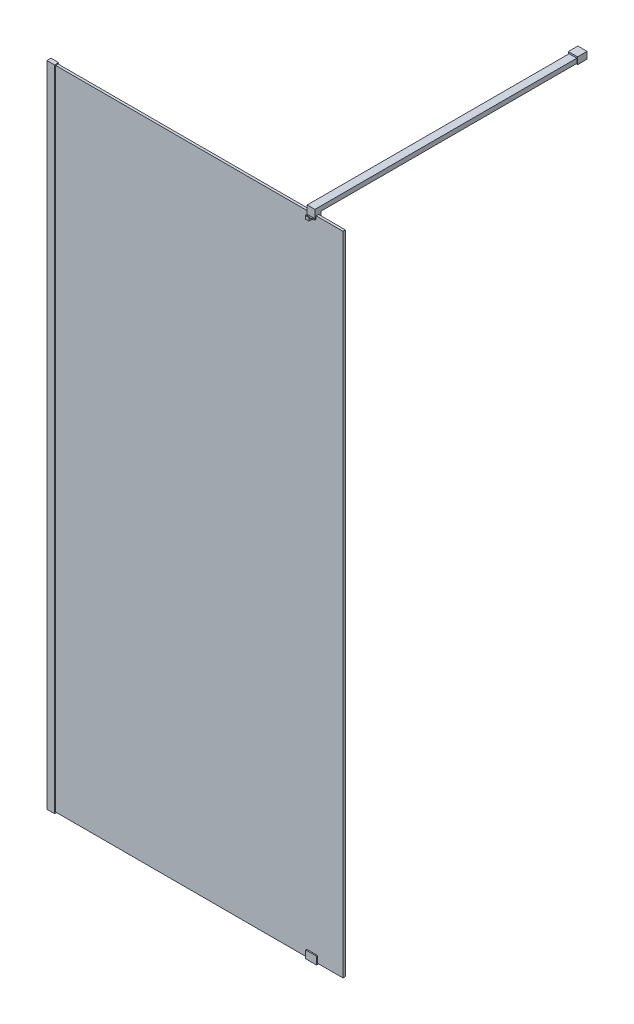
from build123d import *

# Parameters (mm, degrees)
DODANIE_WYCI_GNI_CIE1_DEPTH     = 2100
SZKIC2_W                        = 947
SZKIC2_H                        = 8
DODANIE_WYCI_GNI_CIE2_DEPTH     = 2100
SZKIC4_W                        = 25
SZKIC4_H                        = 13.3
DODANIE_WYCI_GNI_CIE3_DEPTH     = 3
SZKIC5_W                        = 25
SZKIC5_H                        = 13.3
DODANIE_WYCI_GNI_CIE4_DEPTH     = 3
DODANIE_WYCI_GNI_CIE5_DEPTH     = 17.5
DODANIE_WYCI_GNI_CIE6_DEPTH     = 12.5
WYTNIJ_WYCI_GNI_CIE1_DEPTH      = 2312.192714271
WYTNIJ_WYCI_GNI_CIE1_DEPTH_BACK = 2312.192714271
SZKIC10_W                       = 25
SZKIC10_H                       = 861.63
DODANIE_WYCI_GNI_CIE7_DEPTH     = 15
SZKIC14_W                       = 30
SZKIC14_H                       = 22
DODANIE_WYCI_GNI_CIE8_DEPTH     = 31


with BuildPart() as part:
    # Szkic1 → Dodanie-wyci_gni_cie1 (new body)
    with BuildSketch(Plane(origin=(0, 0, 0), x_dir=(1, 0, 0), z_dir=(0, 1, 0))):
        Polygon((0, 0), (0, 13.3), (25, 13.3), (25, 11.4), (11.45, 11.4), (11.45, 3.4), (25, 3.4), (25, 0), align=None)
    extrude(amount=DODANIE_WYCI_GNI_CIE1_DEPTH)

    # Szkic4 → Dodanie-wyci_gni_cie3 (add)
    with BuildSketch(Plane(origin=(0, 2100, 0), x_dir=(1, 0, 0), z_dir=(0, 1, 0))):
        with Locations((12.5, 6.65)):
            Rectangle(SZKIC4_W, SZKIC4_H)
    extrude(amount=DODANIE_WYCI_GNI_CIE3_DEPTH)

    # Szkic5 → Dodanie-wyci_gni_cie4 (add)
    with BuildSketch(Plane.XZ):
        with Locations((12.5, -6.65)):
            Rectangle(SZKIC5_W, SZKIC5_H)
    extrude(amount=DODANIE_WYCI_GNI_CIE4_DEPTH)


with BuildPart() as body_2:
    # Szkic2 → Dodanie-wyci_gni_cie2 (new body)
    with BuildSketch(Plane.XZ):
        with Locations((484.95, -7.4)):
            Rectangle(SZKIC2_W, SZKIC2_H)
    extrude(amount=-DODANIE_WYCI_GNI_CIE2_DEPTH)


with BuildPart() as body_3:
    # Szkic6 → Dodanie-wyci_gni_cie5 (new, symmetric)
    with BuildSketch(Plane(origin=(858.45, 0, 0), x_dir=(0, 0, -1), z_dir=(1, 0, 0))):
        Polygon((11.4, 22), (15.75, 22), (15.75, -3), (-0.35, -3), (-0.35, 22), (3.4, 22), (3.4, 0), (11.4, 0), align=None)
    extrude(amount=DODANIE_WYCI_GNI_CIE5_DEPTH, both=True)


with BuildPart() as body_4:
    # Szkic7 → Dodanie-wyci_gni_cie6 (new, symmetric)
    with BuildSketch(Plane(origin=(858.45, 0, 0), x_dir=(0, 0, -1), z_dir=(1, 0, 0))):
        Polygon((-0.6, 2120), (19.4, 2120), (19.4, 2090), (11.4, 2090), (11.4, 2100), (3.4, 2100), (3.4, 2090), (-13.37, 2090), (-13.37, 2100), (-10.37, 2100), (-9.845068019, 2094), (-0.6, 2094), align=None)
    extrude(amount=DODANIE_WYCI_GNI_CIE6_DEPTH, both=True)

    # Szkic8 → Wytnij-wyci_gni_cie1 (cut, two sides: drawn at the far end of the back side and taken through both)
    with BuildSketch(Plane(origin=(0, 2100, 0), x_dir=(1, 0, 0), z_dir=(0, 1, 0)).offset(-WYTNIJ_WYCI_GNI_CIE1_DEPTH_BACK)):
        Polygon((-742.226795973, 739.979002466), (845.95, -0.6), (852.45, -3.630999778), (852.45, -13.37), (864.45, -13.37), (864.45, -3.630999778), (870.95, -0.6), (2459.126795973, 739.979002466), (2459.126795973, -2764.739413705), (-742.226795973, -2764.739413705), align=None)
    extrude(amount=WYTNIJ_WYCI_GNI_CIE1_DEPTH + WYTNIJ_WYCI_GNI_CIE1_DEPTH_BACK, mode=Mode.SUBTRACT)

    # Szkic10 → Dodanie-wyci_gni_cie7 (add)
    with BuildSketch(Plane(origin=(0, 2120, 0), x_dir=(1, 0, 0), z_dir=(0, 1, 0))):
        with Locations((858.45, 450.215)):
            Rectangle(SZKIC10_W, SZKIC10_H)
    extrude(amount=-DODANIE_WYCI_GNI_CIE7_DEPTH)

    # Szkic14 → Dodanie-wyci_gni_cie8 (add)
    with BuildSketch(Plane(origin=(0, 0, -881.03), x_dir=(-1, 0, 0), z_dir=(0, 0, -1))):
        with Locations((-858.45, 2114)):
            Rectangle(SZKIC14_W, SZKIC14_H)
    extrude(amount=-DODANIE_WYCI_GNI_CIE8_DEPTH)


solid = Compound([part.part, body_2.part, body_3.part, body_4.part])
